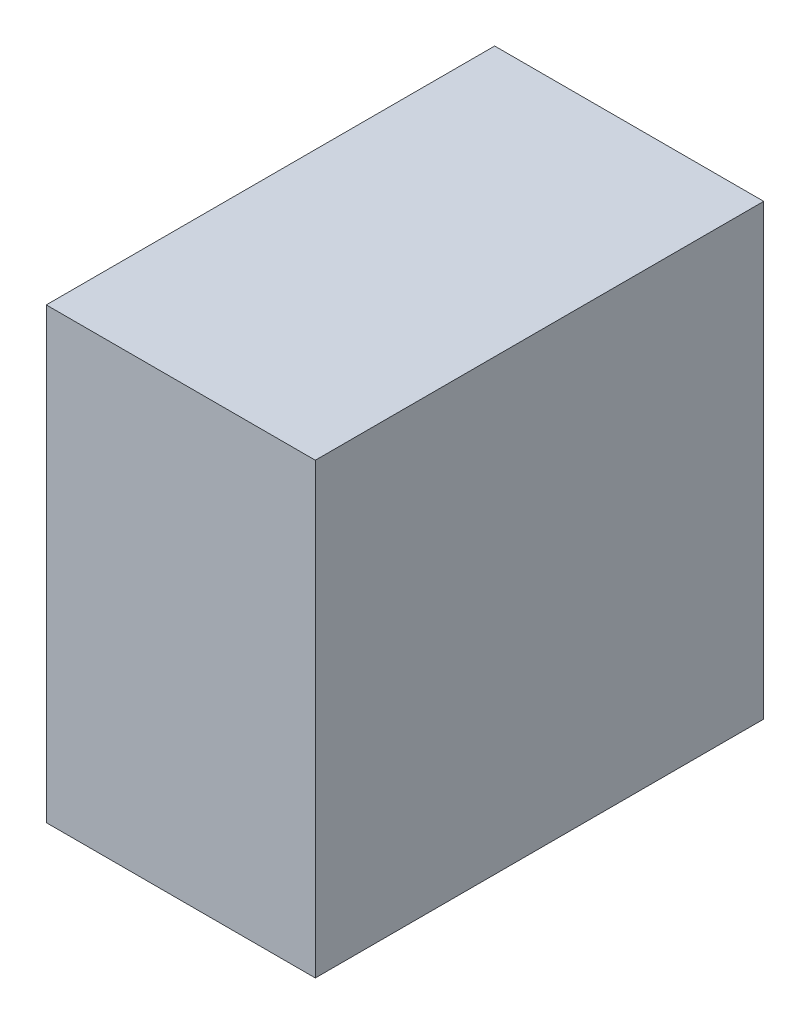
from build123d import *

# Parameters (mm, degrees)
ESQUISSE1_W      = 18
ESQUISSE1_H      = 30
EXTRUSION1_DEPTH = 30


with BuildPart() as part:
    # Esquisse1 → Extrusion1 (new body)
    with BuildSketch(Plane.XY):
        with Locations((9, 15)):
            Rectangle(ESQUISSE1_W, ESQUISSE1_H)
    extrude(amount=EXTRUSION1_DEPTH)


solid = part.part
